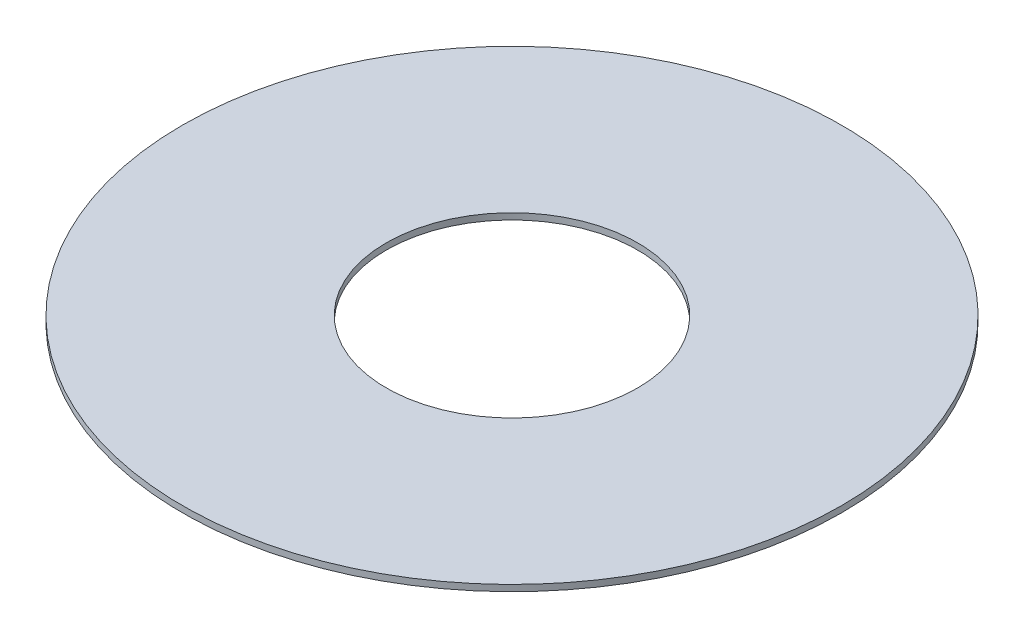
from build123d import *

# Parameters (mm, degrees)
ESQUISSE2_W = 16.212454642
ESQUISSE2_H = 0.5


with BuildPart() as part:
    # Esquisse2 → R_volution1 (revolve)
    with BuildSketch(Plane.XY):
        with Locations((18.106227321, 8.5)):
            Rectangle(ESQUISSE2_W, ESQUISSE2_H)
    revolve(axis=Axis((0, 0, 0), (0, 1, 0)))


solid = part.part
